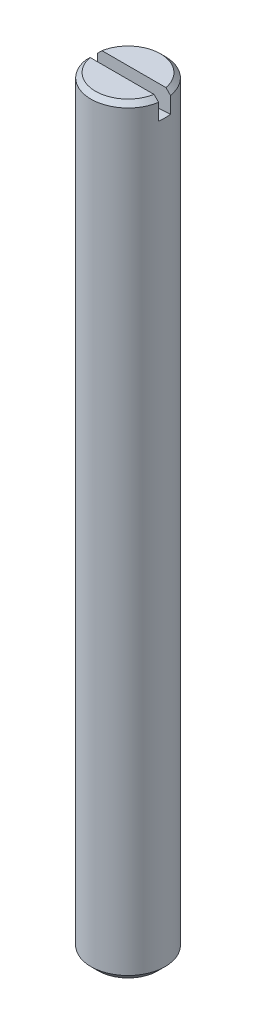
ISO-10303-21;
HEADER;
FILE_DESCRIPTION(('STEP AP214'),'2;1');
FILE_NAME('part.step','',(''),(''),'','','');
FILE_SCHEMA(('AUTOMOTIVE_DESIGN { 1 0 10303 214 1 1 1 1 }'));
ENDSEC;
DATA;
#1=APPLICATION_CONTEXT('core data for automotive mechanical design processes');
#2=APPLICATION_PROTOCOL_DEFINITION('international standard','automotive_design',2000,#1);
#3=PRODUCT_CONTEXT('',#1,'mechanical');
#4=PRODUCT('Part','Part','',(#3));
#5=PRODUCT_RELATED_PRODUCT_CATEGORY('part','',(#4));
#6=PRODUCT_DEFINITION_FORMATION('','',#4);
#7=PRODUCT_DEFINITION_CONTEXT('part definition',#1,'design');
#8=PRODUCT_DEFINITION('design','',#6,#7);
#9=PRODUCT_DEFINITION_SHAPE('','',#8);
#10=(LENGTH_UNIT() NAMED_UNIT(*) SI_UNIT(.MILLI.,.METRE.));
#11=(NAMED_UNIT(*) PLANE_ANGLE_UNIT() SI_UNIT($,.RADIAN.));
#12=(NAMED_UNIT(*) SI_UNIT($,.STERADIAN.) SOLID_ANGLE_UNIT());
#13=UNCERTAINTY_MEASURE_WITH_UNIT(LENGTH_MEASURE(1.E-05),#10,'distance_accuracy_value','');
#14=(GEOMETRIC_REPRESENTATION_CONTEXT(3) GLOBAL_UNCERTAINTY_ASSIGNED_CONTEXT((#13)) GLOBAL_UNIT_ASSIGNED_CONTEXT((#10,
#11,#12)) REPRESENTATION_CONTEXT('',''));
#15=CARTESIAN_POINT('',(0.,0.,0.));
#16=DIRECTION('',(0.,0.,1.));
#17=DIRECTION('',(1.,0.,0.));
#18=AXIS2_PLACEMENT_3D('',#15,#16,#17);
#19=CARTESIAN_POINT('',(0.,41.5,0.));
#20=DIRECTION('',(0.,-1.,0.));
#21=DIRECTION('',(0.,0.,-1.));
#22=AXIS2_PLACEMENT_3D('',#19,#20,#21);
#23=PLANE('',#22);
#24=CARTESIAN_POINT('',(0.,41.499999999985,0.));
#25=DIRECTION('',(0.,-1.,0.));
#26=DIRECTION('',(0.,0.,-1.));
#27=AXIS2_PLACEMENT_3D('',#24,#25,#26);
#28=CIRCLE('',#27,2.19349999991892);
#29=CARTESIAN_POINT('',(-2.1567202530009,41.4999999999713,-0.4));
#30=VERTEX_POINT('',#29);
#31=CARTESIAN_POINT('',(2.1567202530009,41.4999999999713,-0.4));
#32=VERTEX_POINT('',#31);
#33=EDGE_CURVE('E165',#30,#32,#28,.T.);
#34=ORIENTED_EDGE('',*,*,#33,.F.);
#35=DIRECTION('',(1.,0.,0.));
#36=VECTOR('',#35,1.);
#37=CARTESIAN_POINT('',(0.,41.5,-0.4));
#38=LINE('',#37,#36);
#39=EDGE_CURVE('E163',#32,#30,#38,.F.);
#40=ORIENTED_EDGE('',*,*,#39,.F.);
#41=EDGE_LOOP('',(#34,#40));
#42=FACE_BOUND('',#41,.T.);
#43=ADVANCED_FACE('F14',(#42),#23,.F.);
#44=CARTESIAN_POINT('',(0.,41.5,0.));
#45=DIRECTION('',(0.,-1.,0.));
#46=DIRECTION('',(0.,0.,-1.));
#47=AXIS2_PLACEMENT_3D('',#44,#45,#46);
#48=PLANE('',#47);
#49=DIRECTION('',(1.,0.,0.));
#50=VECTOR('',#49,1.);
#51=CARTESIAN_POINT('',(0.,41.5,0.4));
#52=LINE('',#51,#50);
#53=CARTESIAN_POINT('',(-2.1567202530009,41.4999999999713,0.4));
#54=VERTEX_POINT('',#53);
#55=CARTESIAN_POINT('',(2.1567202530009,41.4999999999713,0.4));
#56=VERTEX_POINT('',#55);
#57=EDGE_CURVE('E161',#54,#56,#52,.T.);
#58=ORIENTED_EDGE('',*,*,#57,.F.);
#59=CARTESIAN_POINT('',(0.,41.499999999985,0.));
#60=DIRECTION('',(0.,-1.,0.));
#61=DIRECTION('',(0.,0.,-1.));
#62=AXIS2_PLACEMENT_3D('',#59,#60,#61);
#63=CIRCLE('',#62,2.19349999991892);
#64=EDGE_CURVE('E159',#56,#54,#63,.T.);
#65=ORIENTED_EDGE('',*,*,#64,.F.);
#66=EDGE_LOOP('',(#58,#65));
#67=FACE_BOUND('',#66,.T.);
#68=ADVANCED_FACE('F121',(#67),#48,.F.);
#69=CARTESIAN_POINT('',(0.,41.1934999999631,0.));
#70=DIRECTION('',(0.,-1.,0.));
#71=DIRECTION('',(0.,0.,-1.));
#72=AXIS2_PLACEMENT_3D('',#69,#70,#71);
#73=CONICAL_SURFACE('',#72,2.49999999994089,0.785398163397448);
#74=CARTESIAN_POINT('',(-2.15672025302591,41.4999999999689,-0.400000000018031));
#75=CARTESIAN_POINT('',(-2.20861576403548,41.4489675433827,-0.400000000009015));
#76=CARTESIAN_POINT('',(-2.26048621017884,41.3979096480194,-0.400000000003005));
#77=CARTESIAN_POINT('',(-2.36417697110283,41.2957429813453,-0.399999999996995));
#78=CARTESIAN_POINT('',(-2.41599728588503,41.244634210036,-0.399999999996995));
#79=CARTESIAN_POINT('',(-2.4677925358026,41.1934999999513,-0.4));
#80=B_SPLINE_CURVE_WITH_KNOTS('',3,(#74,#75,#76,#77,#78,#79),.UNSPECIFIED.,.F.,.F.,(4,2,4),(0.,
0.218350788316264,0.436701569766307),.UNSPECIFIED.);
#81=CARTESIAN_POINT('',(-2.46779253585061,41.1934999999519,-0.4));
#82=VERTEX_POINT('',#81);
#83=EDGE_CURVE('E39',#30,#82,#80,.T.);
#84=ORIENTED_EDGE('',*,*,#83,.F.);
#85=ORIENTED_EDGE('',*,*,#33,.T.);
#86=CARTESIAN_POINT('',(2.46779253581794,41.1934999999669,-0.400000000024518));
#87=CARTESIAN_POINT('',(2.41599728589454,41.2446342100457,-0.400000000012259));
#88=CARTESIAN_POINT('',(2.36417697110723,41.2957429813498,-0.400000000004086));
#89=CARTESIAN_POINT('',(2.26048621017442,41.3979096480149,-0.399999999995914));
#90=CARTESIAN_POINT('',(2.20861576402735,41.4489675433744,-0.399999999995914));
#91=CARTESIAN_POINT('',(2.15672025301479,41.4999999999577,-0.4));
#92=B_SPLINE_CURVE_WITH_KNOTS('',3,(#86,#87,#88,#89,#90,#91),.UNSPECIFIED.,.F.,.F.,(4,2,4),(0.,
0.218350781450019,0.436701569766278),.UNSPECIFIED.);
#93=CARTESIAN_POINT('',(2.46779253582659,41.1934999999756,-0.4));
#94=VERTEX_POINT('',#93);
#95=EDGE_CURVE('E134',#94,#32,#92,.T.);
#96=ORIENTED_EDGE('',*,*,#95,.F.);
#97=CARTESIAN_POINT('',(0.,41.1935,0.));
#98=DIRECTION('',(0.,-1.,0.));
#99=DIRECTION('',(0.,0.,-1.));
#100=AXIS2_PLACEMENT_3D('',#97,#98,#99);
#101=CIRCLE('',#100,2.5);
#102=EDGE_CURVE('E9',#82,#94,#101,.T.);
#103=ORIENTED_EDGE('',*,*,#102,.F.);
#104=EDGE_LOOP('',(#84,#85,#96,#103));
#105=FACE_BOUND('',#104,.T.);
#106=ADVANCED_FACE('F116',(#105),#73,.T.);
#107=CARTESIAN_POINT('',(0.,71.5,-0.4));
#108=DIRECTION('',(0.,0.,1.));
#109=DIRECTION('',(1.,0.,0.));
#110=AXIS2_PLACEMENT_3D('',#107,#108,#109);
#111=PLANE('',#110);
#112=ORIENTED_EDGE('',*,*,#39,.T.);
#113=ORIENTED_EDGE('',*,*,#83,.T.);
#114=DIRECTION('',(0.,1.,0.));
#115=VECTOR('',#114,1.);
#116=CARTESIAN_POINT('',(-2.46779253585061,71.5,-0.4));
#117=LINE('',#116,#115);
#118=CARTESIAN_POINT('',(-2.46779253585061,40.096815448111,-0.4));
#119=VERTEX_POINT('',#118);
#120=EDGE_CURVE('E154',#82,#119,#117,.F.);
#121=ORIENTED_EDGE('',*,*,#120,.T.);
#122=CARTESIAN_POINT('',(0.,71.5,-0.4));
#123=DIRECTION('',(0.,0.,-1.));
#124=DIRECTION('',(-1.,0.,0.));
#125=AXIS2_PLACEMENT_3D('',#122,#123,#124);
#126=CIRCLE('',#125,31.5);
#127=CARTESIAN_POINT('',(2.46779253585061,40.096815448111,-0.4));
#128=VERTEX_POINT('',#127);
#129=EDGE_CURVE('E88',#119,#128,#126,.F.);
#130=ORIENTED_EDGE('',*,*,#129,.T.);
#131=DIRECTION('',(0.,1.,0.));
#132=VECTOR('',#131,1.);
#133=CARTESIAN_POINT('',(2.46779253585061,71.5,-0.4));
#134=LINE('',#133,#132);
#135=EDGE_CURVE('E140',#128,#94,#134,.T.);
#136=ORIENTED_EDGE('',*,*,#135,.T.);
#137=ORIENTED_EDGE('',*,*,#95,.T.);
#138=EDGE_LOOP('',(#112,#113,#121,#130,#136,#137));
#139=FACE_BOUND('',#138,.T.);
#140=ADVANCED_FACE('F120',(#139),#111,.T.);
#141=CARTESIAN_POINT('',(0.,41.1934999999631,0.));
#142=DIRECTION('',(0.,-1.,0.));
#143=DIRECTION('',(0.,0.,-1.));
#144=AXIS2_PLACEMENT_3D('',#141,#142,#143);
#145=CONICAL_SURFACE('',#144,2.49999999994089,0.785398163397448);
#146=ORIENTED_EDGE('',*,*,#64,.T.);
#147=CARTESIAN_POINT('',(-2.15672025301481,41.4999999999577,0.4));
#148=CARTESIAN_POINT('',(-2.20861576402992,41.448967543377,0.4));
#149=CARTESIAN_POINT('',(-2.26048621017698,41.3979096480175,0.4));
#150=CARTESIAN_POINT('',(-2.36417697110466,41.2957429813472,0.4));
#151=CARTESIAN_POINT('',(-2.41599728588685,41.2446342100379,0.4));
#152=CARTESIAN_POINT('',(-2.46779253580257,41.1934999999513,0.4));
#153=B_SPLINE_CURVE_WITH_KNOTS('',3,(#147,#148,#149,#150,#151,#152),.UNSPECIFIED.,.F.,.F.,(4,2,
4),(0.,0.218350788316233,0.436701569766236),.UNSPECIFIED.);
#154=CARTESIAN_POINT('',(-2.46779253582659,41.1934999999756,0.4));
#155=VERTEX_POINT('',#154);
#156=EDGE_CURVE('E149',#54,#155,#153,.T.);
#157=ORIENTED_EDGE('',*,*,#156,.T.);
#158=CARTESIAN_POINT('',(0.,41.1935,0.));
#159=DIRECTION('',(0.,-1.,0.));
#160=DIRECTION('',(0.,0.,-1.));
#161=AXIS2_PLACEMENT_3D('',#158,#159,#160);
#162=CIRCLE('',#161,2.5);
#163=CARTESIAN_POINT('',(2.46779253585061,41.1934999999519,0.4));
#164=VERTEX_POINT('',#163);
#165=EDGE_CURVE('E30',#164,#155,#162,.T.);
#166=ORIENTED_EDGE('',*,*,#165,.F.);
#167=CARTESIAN_POINT('',(2.46779253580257,41.1934999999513,0.4));
#168=CARTESIAN_POINT('',(2.41599728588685,41.2446342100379,0.4));
#169=CARTESIAN_POINT('',(2.36417697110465,41.2957429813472,0.4));
#170=CARTESIAN_POINT('',(2.26048621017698,41.3979096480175,0.4));
#171=CARTESIAN_POINT('',(2.20861576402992,41.448967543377,0.4));
#172=CARTESIAN_POINT('',(2.15672025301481,41.4999999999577,0.4));
#173=B_SPLINE_CURVE_WITH_KNOTS('',3,(#167,#168,#169,#170,#171,#172),.UNSPECIFIED.,.F.,.F.,(4,2,
4),(0.,0.21835078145,0.436701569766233),.UNSPECIFIED.);
#174=EDGE_CURVE('E96',#164,#56,#173,.T.);
#175=ORIENTED_EDGE('',*,*,#174,.T.);
#176=EDGE_LOOP('',(#146,#157,#166,#175));
#177=FACE_BOUND('',#176,.T.);
#178=ADVANCED_FACE('F122',(#177),#145,.T.);
#179=CARTESIAN_POINT('',(0.,71.5,0.4));
#180=DIRECTION('',(0.,0.,1.));
#181=DIRECTION('',(1.,0.,0.));
#182=AXIS2_PLACEMENT_3D('',#179,#180,#181);
#183=PLANE('',#182);
#184=ORIENTED_EDGE('',*,*,#57,.T.);
#185=ORIENTED_EDGE('',*,*,#174,.F.);
#186=DIRECTION('',(0.,1.,0.));
#187=VECTOR('',#186,1.);
#188=CARTESIAN_POINT('',(2.46779253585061,71.5,0.4));
#189=LINE('',#188,#187);
#190=CARTESIAN_POINT('',(2.46779253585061,40.096815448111,0.4));
#191=VERTEX_POINT('',#190);
#192=EDGE_CURVE('E94',#191,#164,#189,.T.);
#193=ORIENTED_EDGE('',*,*,#192,.F.);
#194=CARTESIAN_POINT('',(0.,71.5,0.4));
#195=DIRECTION('',(0.,0.,-1.));
#196=DIRECTION('',(-1.,0.,0.));
#197=AXIS2_PLACEMENT_3D('',#194,#195,#196);
#198=CIRCLE('',#197,31.5);
#199=CARTESIAN_POINT('',(-2.46779253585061,40.096815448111,0.4));
#200=VERTEX_POINT('',#199);
#201=EDGE_CURVE('E81',#200,#191,#198,.F.);
#202=ORIENTED_EDGE('',*,*,#201,.F.);
#203=DIRECTION('',(0.,1.,0.));
#204=VECTOR('',#203,1.);
#205=CARTESIAN_POINT('',(-2.46779253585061,71.5,0.4));
#206=LINE('',#205,#204);
#207=EDGE_CURVE('E73',#155,#200,#206,.F.);
#208=ORIENTED_EDGE('',*,*,#207,.F.);
#209=ORIENTED_EDGE('',*,*,#156,.F.);
#210=EDGE_LOOP('',(#184,#185,#193,#202,#208,#209));
#211=FACE_BOUND('',#210,.T.);
#212=ADVANCED_FACE('F92',(#211),#183,.F.);
#213=CARTESIAN_POINT('',(0.,71.5,0.4));
#214=DIRECTION('',(0.,0.,-1.));
#215=DIRECTION('',(-1.,0.,0.));
#216=AXIS2_PLACEMENT_3D('',#213,#214,#215);
#217=CYLINDRICAL_SURFACE('',#216,31.5);
#218=CARTESIAN_POINT('',(2.46779253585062,40.096815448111,-0.4));
#219=CARTESIAN_POINT('',(2.47854531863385,40.0976618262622,-0.333698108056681));
#220=CARTESIAN_POINT('',(2.48661458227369,40.098300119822,-0.266959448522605));
#221=CARTESIAN_POINT('',(2.49732458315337,40.0991493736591,-0.133478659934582));
#222=CARTESIAN_POINT('',(2.5,40.0993630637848,-0.066739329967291));
#223=CARTESIAN_POINT('',(2.5,40.0993630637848,0.066739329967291));
#224=CARTESIAN_POINT('',(2.49732458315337,40.0991493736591,0.133478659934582));
#225=CARTESIAN_POINT('',(2.48661458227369,40.098300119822,0.266959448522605));
#226=CARTESIAN_POINT('',(2.47854531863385,40.0976618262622,0.333698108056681));
#227=CARTESIAN_POINT('',(2.46779253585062,40.096815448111,0.4));
#228=B_SPLINE_CURVE_WITH_KNOTS('',3,(#218,#219,#220,#221,#222,#223,#224,#225,#226,#227),
.UNSPECIFIED.,.F.,.F.,(4,2,2,2,4),(0.,0.201464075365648,0.401628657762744,0.601793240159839,
0.803257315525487),.UNSPECIFIED.);
#229=EDGE_CURVE('E82',#128,#191,#228,.T.);
#230=ORIENTED_EDGE('',*,*,#229,.F.);
#231=ORIENTED_EDGE('',*,*,#129,.F.);
#232=CARTESIAN_POINT('',(-2.46779253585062,40.096815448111,0.4));
#233=CARTESIAN_POINT('',(-2.47854531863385,40.0976618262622,0.333698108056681));
#234=CARTESIAN_POINT('',(-2.48661458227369,40.098300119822,0.266959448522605));
#235=CARTESIAN_POINT('',(-2.49732458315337,40.0991493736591,0.133478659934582));
#236=CARTESIAN_POINT('',(-2.5,40.0993630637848,0.066739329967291));
#237=CARTESIAN_POINT('',(-2.5,40.0993630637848,-0.066739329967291));
#238=CARTESIAN_POINT('',(-2.49732458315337,40.0991493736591,-0.133478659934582));
#239=CARTESIAN_POINT('',(-2.48661458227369,40.098300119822,-0.266959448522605));
#240=CARTESIAN_POINT('',(-2.47854531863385,40.0976618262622,-0.333698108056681));
#241=CARTESIAN_POINT('',(-2.46779253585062,40.096815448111,-0.4));
#242=B_SPLINE_CURVE_WITH_KNOTS('',3,(#232,#233,#234,#235,#236,#237,#238,#239,#240,#241),
.UNSPECIFIED.,.F.,.F.,(4,2,2,2,4),(0.,0.201464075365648,0.401628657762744,0.601793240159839,
0.803257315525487),.UNSPECIFIED.);
#243=EDGE_CURVE('E19',#200,#119,#242,.T.);
#244=ORIENTED_EDGE('',*,*,#243,.F.);
#245=ORIENTED_EDGE('',*,*,#201,.T.);
#246=EDGE_LOOP('',(#230,#231,#244,#245));
#247=FACE_BOUND('',#246,.T.);
#248=ADVANCED_FACE('F16',(#247),#217,.F.);
#249=CARTESIAN_POINT('',(0.,30.,0.));
#250=DIRECTION('',(0.,-1.,0.));
#251=DIRECTION('',(0.,0.,-1.));
#252=AXIS2_PLACEMENT_3D('',#249,#250,#251);
#253=CYLINDRICAL_SURFACE('',#252,2.5);
#254=ORIENTED_EDGE('',*,*,#229,.T.);
#255=ORIENTED_EDGE('',*,*,#192,.T.);
#256=ORIENTED_EDGE('',*,*,#165,.T.);
#257=ORIENTED_EDGE('',*,*,#207,.T.);
#258=ORIENTED_EDGE('',*,*,#243,.T.);
#259=ORIENTED_EDGE('',*,*,#120,.F.);
#260=ORIENTED_EDGE('',*,*,#102,.T.);
#261=ORIENTED_EDGE('',*,*,#135,.F.);
#262=EDGE_LOOP('',(#254,#255,#256,#257,#258,#259,#260,#261));
#263=FACE_BOUND('',#262,.T.);
#264=CARTESIAN_POINT('',(0.,-9.5095,0.));
#265=DIRECTION('',(0.,-1.,0.));
#266=DIRECTION('',(0.,0.,-1.));
#267=AXIS2_PLACEMENT_3D('',#264,#265,#266);
#268=CIRCLE('',#267,2.5);
#269=CARTESIAN_POINT('',(0.,-9.5095,-2.5));
#270=VERTEX_POINT('',#269);
#271=EDGE_CURVE('E172',#270,#270,#268,.F.);
#272=ORIENTED_EDGE('',*,*,#271,.T.);
#273=EDGE_LOOP('',(#272));
#274=FACE_BOUND('',#273,.T.);
#275=ADVANCED_FACE('F75',(#263,#274),#253,.T.);
#276=CARTESIAN_POINT('',(2.0095,-10.,0.));
#277=DIRECTION('',(0.,1.,0.));
#278=DIRECTION('',(0.,0.,1.));
#279=AXIS2_PLACEMENT_3D('',#276,#277,#278);
#280=PLANE('',#279);
#281=CARTESIAN_POINT('',(0.,-10.0000000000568,0.));
#282=DIRECTION('',(0.,1.,0.));
#283=DIRECTION('',(0.,0.,1.));
#284=AXIS2_PLACEMENT_3D('',#281,#282,#283);
#285=CIRCLE('',#284,2.00949999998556);
#286=CARTESIAN_POINT('',(0.,-10.0000000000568,2.00949999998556));
#287=VERTEX_POINT('',#286);
#288=EDGE_CURVE('E90',#287,#287,#285,.T.);
#289=ORIENTED_EDGE('',*,*,#288,.F.);
#290=EDGE_LOOP('',(#289));
#291=FACE_BOUND('',#290,.T.);
#292=ADVANCED_FACE('F113',(#291),#280,.F.);
#293=CARTESIAN_POINT('',(0.,-9.50949999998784,0.));
#294=DIRECTION('',(0.,1.,0.));
#295=DIRECTION('',(0.,0.,1.));
#296=AXIS2_PLACEMENT_3D('',#293,#294,#295);
#297=CONICAL_SURFACE('',#296,2.50000000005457,0.785398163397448);
#298=ORIENTED_EDGE('',*,*,#271,.F.);
#299=EDGE_LOOP('',(#298));
#300=FACE_BOUND('',#299,.T.);
#301=ORIENTED_EDGE('',*,*,#288,.T.);
#302=EDGE_LOOP('',(#301));
#303=FACE_BOUND('',#302,.T.);
#304=ADVANCED_FACE('F114',(#300,#303),#297,.T.);
#305=CLOSED_SHELL('',(#43,#68,#106,#140,#178,#212,#248,#275,#292,#304));
#306=MANIFOLD_SOLID_BREP('B1',#305);
#307=ADVANCED_BREP_SHAPE_REPRESENTATION('',(#18,#306),#14);
#308=SHAPE_DEFINITION_REPRESENTATION(#9,#307);
ENDSEC;
END-ISO-10303-21;
